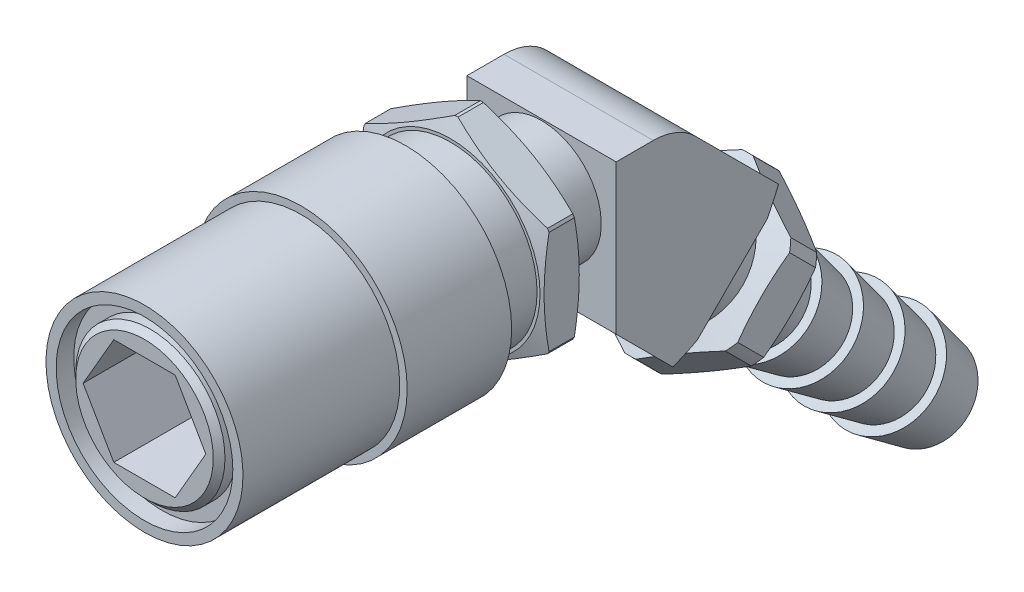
from build123d import *

# Parameters (mm, degrees)
SKETCH2_R                = 9.017
BOSS_EXTRUDE1_DEPTH      = 29.21
SKETCH5_OUTSIDE_W        = 27.79
SKETCH5_OUTSIDE_H        = 27.79
CUT_EXTRUDE1_DEPTH       = 3.175
SKETCH6_W                = 3.81
SKETCH6_H                = 20
SKETCH11_R               = 7.517
SKETCH11_R_2             = 6.35
CUT_EXTRUDE3_DEPTH       = 1.5
SKETCH23_R               = 5.08
CUT_EXTRUDE7_DEPTH       = 6.35
SKETCH27_W               = 13.335
SKETCH27_H               = 0.635
CHAMFER5_SIZE            = 0.381
CHAMFER7_SIZE            = 0.5
BOSS_EXTRUDE3_DEPTH      = 4.572
BOSS_EXTRUDE3_DEPTH_BACK = 6.35
SKETCH13_R               = 5.08
BOSS_EXTRUDE6_DEPTH      = 6.35
FILLET1_R                = 5.08
SKETCH30_R               = 7.0739
BOSS_EXTRUDE5_DEPTH      = 7.62
SKETCH16_OUTSIDE_W       = 32.714
SKETCH16_OUTSIDE_H       = 72.555
CUT_EXTRUDE4_DEPTH       = 4.572
CUT_EXTRUDE8_DEPTH       = 13.335


with BuildPart() as part:
    # Sketch2 → Boss-Extrude1 (new body)
    with BuildSketch(Plane.XY):
        Circle(SKETCH2_R)
    extrude(amount=-BOSS_EXTRUDE1_DEPTH)

    # Sketch5 outside → Cut-Extrude1 (cut)
    with BuildSketch(Plane(origin=(0, 0, -29.21), x_dir=(-1, 0, 0), z_dir=(0, 0, -1))):
        Rectangle(SKETCH5_OUTSIDE_W, SKETCH5_OUTSIDE_H)
        Polygon((-7.874, -4.54605602), (0, -9.092112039), (7.874, -4.54605602), (7.874, 4.54605602), (0, 9.092112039), (-7.874, 4.54605602), align=None, mode=Mode.SUBTRACT)
    extrude(amount=-CUT_EXTRUDE1_DEPTH, mode=Mode.SUBTRACT)

    # Sketch6 → Cut-Revolve1 (revolve, cut)
    with BuildSketch(Plane(origin=(0, 0, 0), x_dir=(0, 0, -1), z_dir=(1, 0, 0)), mode=Mode.PRIVATE) as cut_revolve1_sk:
        with Locations((24.13, 17.366)):
            Rectangle(SKETCH6_W, SKETCH6_H)
    revolve(cut_revolve1_sk.sketch.rotate(Axis((0, 0, 0), (0, 0, -1)), 90), axis=Axis((0, 0, 0), (0, 0, -1)), mode=Mode.SUBTRACT)

    # Sketch11 → Cut-Extrude3 (cut)
    with BuildSketch(Plane.XY):
        Circle(SKETCH11_R)
        Circle(SKETCH11_R_2, mode=Mode.SUBTRACT)
    extrude(amount=-CUT_EXTRUDE3_DEPTH, mode=Mode.SUBTRACT)

    # Sketch12 → Cut-Revolve2 (revolve, cut)
    with BuildSketch(Plane(origin=(0, 0, 0), x_dir=(0, 0, -1), z_dir=(1, 0, 0)), mode=Mode.PRIVATE) as cut_revolve2_sk:
        Polygon((26.035, 10.286037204), (26.035, 7.62), (27.005358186, 10.286037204), align=None)
        Polygon((28.239641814, 10.286037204), (29.21, 10.286037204), (29.21, 7.62), align=None)
    revolve(cut_revolve2_sk.sketch.rotate(Axis((0, 0, 0), (0, 0, -1)), 240.837293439), axis=Axis((0, 0, 0), (0, 0, -1)), mode=Mode.SUBTRACT)

    # Sketch23 → Cut-Extrude7 (cut)
    with BuildSketch(Plane(origin=(0, 0, -29.21), x_dir=(-1, 0, 0), z_dir=(0, 0, -1))):
        Circle(SKETCH23_R)
    extrude(amount=-CUT_EXTRUDE7_DEPTH, mode=Mode.SUBTRACT)

    # Sketch27 → Cut-Revolve5 (revolve, cut)
    with BuildSketch(Plane(origin=(0, 0, 0), x_dir=(0, 0, -1), z_dir=(1, 0, 0)), mode=Mode.PRIVATE) as cut_revolve5_sk:
        with Locations((6.6675, 8.6995)):
            Rectangle(SKETCH27_W, SKETCH27_H)
    revolve(cut_revolve5_sk.sketch.rotate(Axis((0, 0, 0), (0, 0, -1)), 90), axis=Axis((0, 0, 0), (0, 0, -1)), mode=Mode.SUBTRACT)

    # Chamfer5
    chamfer5_edges = [part.edges().sort_by_distance(p)[0] for p in [
        (5.08, 0, -29.21),
    ]]
    chamfer(chamfer5_edges, length=CHAMFER5_SIZE)

    # Chamfer7
    chamfer7_edges = [part.edges().sort_by_distance(p)[0] for p in [
        (-6.35, 0, 0),
    ]]
    chamfer(chamfer7_edges, length=CHAMFER7_SIZE)


with BuildPart() as body_2:
    # Sketch13 → Boss-Extrude3 (new, two sides: drawn at the far end of the back side and taken through both)
    with BuildSketch(Plane(origin=(0, 0, -29.21), x_dir=(-1, 0, 0), z_dir=(0, 0, -1)).offset(-BOSS_EXTRUDE3_DEPTH_BACK)):
        Circle(SKETCH13_R)
    extrude(amount=BOSS_EXTRUDE3_DEPTH + BOSS_EXTRUDE3_DEPTH_BACK)

    # Sketch32 → Boss-Extrude6 (add, symmetric)
    with BuildSketch(Plane(origin=(0, 0, 0), x_dir=(0, 0, -1), z_dir=(1, 0, 0))):
        Polygon((33.782, 5.207), (33.782, -7.493), (39.170153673, -12.881153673), (48.150409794, -3.900897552), (39.042512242, 5.207), align=None)
    extrude(amount=BOSS_EXTRUDE6_DEPTH, both=True)

    # Fillet1
    fillet1_edges = [body_2.edges().sort_by_distance(p)[0] for p in [
        (0, 5.207, -39.042512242),
    ]]
    fillet(fillet1_edges, radius=FILLET1_R)

    # Sketch30 → Boss-Extrude5 (add)
    with BuildSketch(Plane(origin=(0, -51.575496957, -0.475810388), x_dir=(1, 0, 0), z_dir=(0, -0.7071067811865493, -0.7071067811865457))):
        with Locations(Location((0, -61.07206506, 0), (0, 0, 63.852958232))):
            Circle(SKETCH30_R)
    extrude(amount=BOSS_EXTRUDE5_DEPTH)

    # Sketch16 outside → Cut-Extrude4 (cut)
    with BuildSketch(Plane(origin=(0, -31.413807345, -31.413807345), x_dir=(1, 0, 0), z_dir=(0, -0.70710678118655, -0.707106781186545))):
        with Locations((0, -15.6575)):
            Rectangle(SKETCH16_OUTSIDE_W, SKETCH16_OUTSIDE_H)
        Polygon((0, -32.271478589), (6.35, -28.60530438), (6.35, -21.272955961), (0, -17.606781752), (-6.35, -21.272955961), (-6.35, -28.60530438), align=None, mode=Mode.SUBTRACT)
    extrude(amount=-CUT_EXTRUDE4_DEPTH, mode=Mode.SUBTRACT)

    # Sketch19 → Cut-Revolve3 (revolve, cut)
    with BuildSketch(Plane(origin=(0, 0, 0), x_dir=(0, 0, -1), z_dir=(1, 0, 0))):
        Polygon((47.252384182, -4.798923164), (51.742512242, -0.308795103), (53.897773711, -2.464056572), (49.407645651, -6.954184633), align=None)
    revolve(axis=Axis((0, -50.08879034, -85.358046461), (0, 0.7071067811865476, 0.7071067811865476)), mode=Mode.SUBTRACT)

    # Sketch31 → Revolve1 (revolve)
    with BuildSketch(Plane(origin=(0, 0, 0), x_dir=(0, 0, -1), z_dir=(1, 0, 0)), mode=Mode.PRIVATE) as revolve1_sk:
        Polygon((69.010585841, -28.532781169), (65.948318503, -24.41084361), (65.418483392, -24.940678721), (62.412784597, -20.875309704), (61.882949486, -21.405144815), (58.877250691, -17.339775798), (58.34741558, -17.869610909), (55.341716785, -13.804241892), (54.811881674, -14.334077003), (52.182544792, -10.645069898), (49.048435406, -13.779179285), (66.406311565, -31.137055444), align=None)
    revolve(revolve1_sk.sketch.rotate(Axis((0, -33.808821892, -69.078078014), (0, -0.7071067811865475, -0.7071067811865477)), 180), axis=Axis((0, -33.808821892, -69.078078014), (0, -0.7071067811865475, -0.7071067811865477)))

    # Sketch33 → Cut-Revolve8 (revolve, cut)
    with BuildSketch(Plane(origin=(0, 0, 0), x_dir=(0, 0, -1), z_dir=(1, 0, 0)), mode=Mode.PRIVATE) as cut_revolve8_sk:
        Polygon((49.407645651, -6.954184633), (51.203696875, -5.158133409), (51.85740606, -5.811842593), align=None)
        Polygon((52.640537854, -10.187076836), (54.436589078, -8.391025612), (53.782879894, -7.737316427), align=None)
        Polygon((49.048435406, -3.002871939), (58.028691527, 5.977384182), (52.843938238, 11.16213747), align=None)
    revolve(cut_revolve8_sk.sketch.rotate(Axis((0, -29.378701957, -64.647958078), (0, -0.7071067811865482, -0.7071067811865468)), 180), axis=Axis((0, -29.378701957, -64.647958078), (0, -0.7071067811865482, -0.7071067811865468)), mode=Mode.SUBTRACT)


with BuildPart() as cut_revolve7_tool:
    # Sketch29 → Cut-Revolve7 (revolve)
    with BuildSketch(Plane(origin=(0, 0, 0), x_dir=(0, 0, -1), z_dir=(1, 0, 0))):
        Polygon((0, 0), (39.229666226, 0), (36.938307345, 3.96875), (13.335, 3.96875), (13.335, 4.445), (0, 4.445), align=None)
    revolve(axis=Axis((0, 0, 3.947771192), (0, 0, -1)))


with BuildPart() as part_1:
    add(part.part)

    # Cut-Revolve7: cut by cut_revolve7_tool
    add(cut_revolve7_tool.part, mode=Mode.SUBTRACT)

    # Sketch34 → Cut-Extrude8 (cut)
    with BuildSketch(Plane.XY):
        Polygon((-2.610316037, 4.5212), (-5.220632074, 0), (-2.610316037, -4.5212), (2.610316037, -4.5212), (5.220632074, 0), (2.610316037, 4.5212), align=None)
    extrude(amount=-CUT_EXTRUDE8_DEPTH, mode=Mode.SUBTRACT)


with BuildPart() as body_2_1:
    add(body_2.part)

    # Cut-Revolve7: cut by cut_revolve7_tool
    add(cut_revolve7_tool.part, mode=Mode.SUBTRACT)

    # Sketch28 → Cut-Revolve6 (revolve, cut)
    with BuildSketch(Plane(origin=(0, 0, 0), x_dir=(0, 0, -1), z_dir=(1, 0, 0))):
        Polygon((66.406311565, -31.137055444), (32.491913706, 2.777342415), (35.324915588, 3.536442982), (68.20236279, -29.34100422), align=None)
    revolve(axis=Axis((0, 2.777342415, -32.491913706), (0, -0.7071067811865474, -0.7071067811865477)), mode=Mode.SUBTRACT)


solid = Compound([part_1.part, body_2_1.part])
